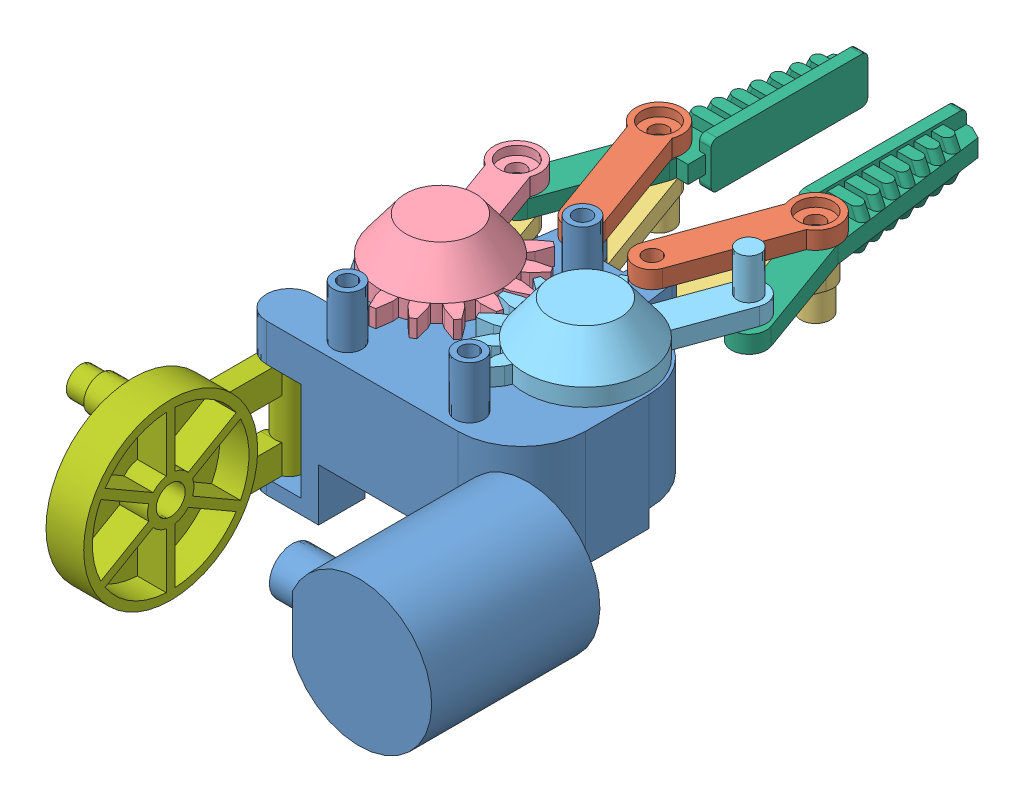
SolidWorks assembly RDM - Pinza.sldasm, configuration Predeterminado (file format 6000). Lengths in mm.
Overall size (72.68 40 125.68).
11 component instances, 7 part files, 0 mates.
Components (placement in the parent):
- RDM - Motor 5_Simple-1: RDM - Motor 5_Simple.sldprt [Predeterminado] at origin size (60.5 36.5 71)
- Brazo 2-1: Brazo 2.sldprt [Predeterminado] at (-13.5 17 -60.6821) x (0.340909 0 0.940096) z (-0.940096 0 0.340909) size (29 3 8)
- Brazo 4-1: Brazo 4.sldprt [Predeterminado] at (13.5 13 -60.6821) x (-0.340909 0 0.940096) z (0.940096 0 0.340909) size (28 9 6)
- Engrane izquierdo-1: Engrane izquierdo.sldprt [Predeterminado] at (-12.5 17 -22) x (-0.805745 0 -0.592263) z (0.592263 0 -0.805745) size (36.29 9 26.72)
- RDM - Engranes pinzas-1: RDM - Engranes pinzas.sldprt [Predeterminado] at (12.5 17 -22) x (0.940096 0 0.340909) z (-0.340909 0 0.940096) size (24.5 10 39)
- RDM - Pinza-1: RDM - Pinza.sldprt [Predeterminado] at (-20 14.5 -42.6821) size (15.5 8 51)
- RDM - Soporte M5-1: RDM - Soporte M5.sldprt [Predeterminado] at (-17 2 20) x (0 -1 0) z (0 0 -1) size (30 15.5 41.5)
- Brazo 4-2: Brazo 4.sldprt [Predeterminado] at (-13.5 13 -60.6821) x (0.340909 0 0.940096) z (0.940096 0 -0.340909) size (28 9 6)
- Brazo 4-3: Brazo 4.sldprt [Predeterminado] at (-20 13 -42.6821) x (0.340909 0 0.940096) z (0.940096 0 -0.340909) size (28 9 6)
- Brazo 2-2: Brazo 2.sldprt [Predeterminado] at (13.5 17 -60.6821) x (-0.340909 0 0.940096) z (-0.940096 0 -0.340909) size (29 3 8)
- RDM - Pinza-2: RDM - Pinza.sldprt [Predeterminado] at (20 14.5 -42.6821) x (-1 0 0) z (0 0 1) size (15.5 8 51)
